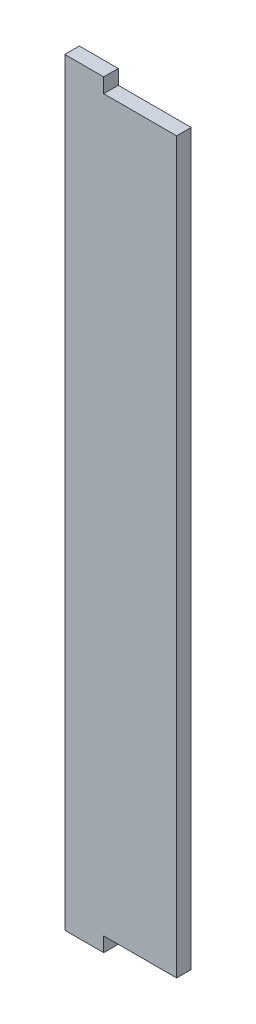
from build123d import *

# Parameters (mm, degrees)
SKETCH_1_W      = 23
SKETCH_1_H      = 150
EXTRUDE_1_DEPTH = 3
SKETCH_2_W      = 8
SKETCH_2_H      = 3
EXTRUDE_2_DEPTH = 3


with BuildPart() as part:
    # Sketch 1 → Extrude 1 (new body)
    with BuildSketch(Plane.XY):
        Rectangle(SKETCH_1_W, SKETCH_1_H)
    extrude(amount=EXTRUDE_1_DEPTH)

    # Sketch 2 → Extrude 2 (add)
    with BuildSketch(Plane.XY):
        with Locations((-7.5, 76.5)):
            Rectangle(SKETCH_2_W, SKETCH_2_H)
        with Locations((-7.5, -76.5)):
            Rectangle(SKETCH_2_W, SKETCH_2_H)
    extrude(amount=EXTRUDE_2_DEPTH)


solid = part.part
